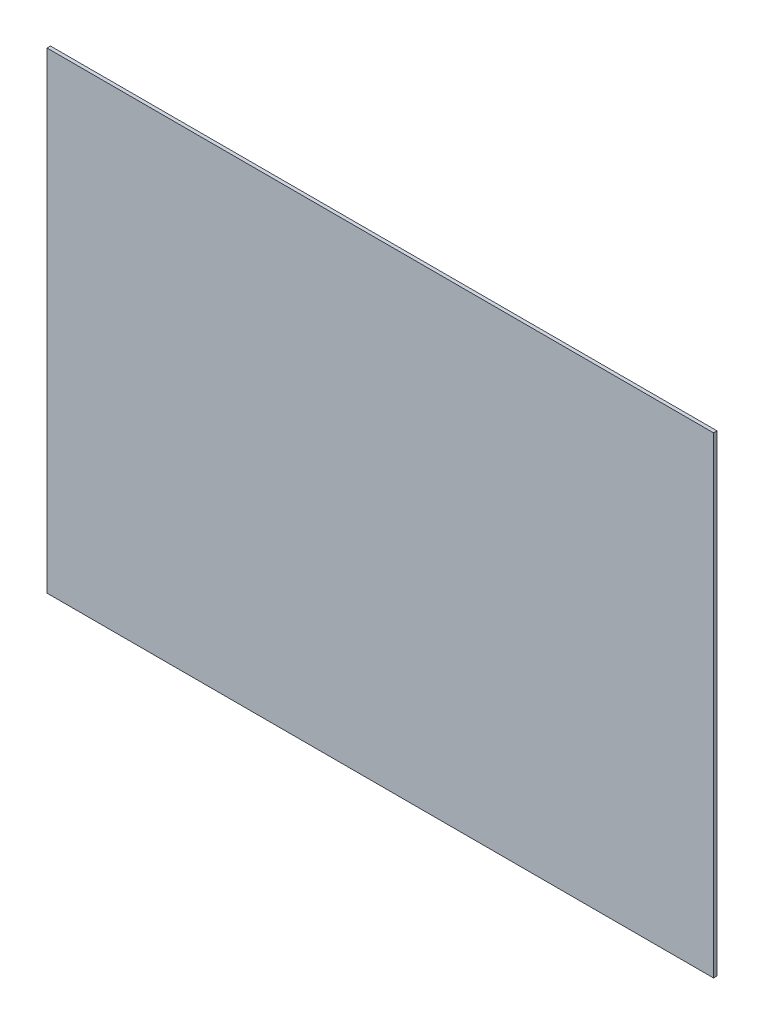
from build123d import *

# Parameters (mm, degrees)
SKETCH1_W           = 609.6
SKETCH1_H           = 431.8
BOSS_EXTRUDE1_DEPTH = 3.175


with BuildPart() as part:
    # Sketch1 → Boss-Extrude1 (new body)
    with BuildSketch(Plane.XY):
        Rectangle(SKETCH1_W, SKETCH1_H)
    extrude(amount=BOSS_EXTRUDE1_DEPTH)


solid = part.part
